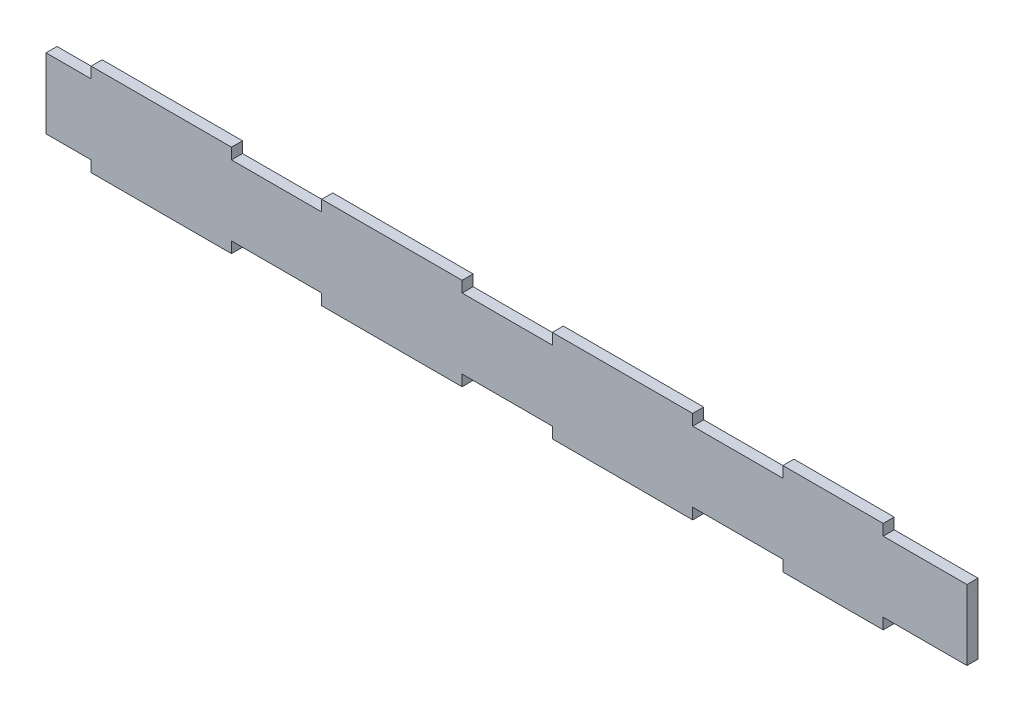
from build123d import *

# Parameters (mm, degrees)
BOSS_EXTRUDE1_DEPTH = 5.5


with BuildPart() as part:
    # Sketch1 → Boss-Extrude1 (new body)
    with BuildSketch(Plane.XY):
        Polygon((136.66821054, 49.948394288), (186.66821054, 49.948394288), (186.66821054, 55.448394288), (206.66821054, 55.448394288), (228.449972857, 55.448394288), (228.449972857, 90.448394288), (206.66821054, 90.448394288), (186.66821054, 90.448394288), (186.66821054, 95.948394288), (136.66821054, 95.948394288), (136.66821054, 90.448394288), (91.66821054, 90.448394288), (91.66821054, 95.948394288), (21.66821054, 95.948394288), (21.66821054, 90.448394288), (-23.33178946, 90.448394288), (-23.33178946, 95.948394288), (-93.33178946, 95.948394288), (-93.33178946, 90.448394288), (-138.33178946, 90.448394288), (-138.33178946, 95.948394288), (-208.33178946, 95.948394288), (-208.33178946, 90.448394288), (-230.83178946, 90.448394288), (-230.83178946, 55.448394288), (-208.33178946, 55.448394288), (-208.33178946, 49.948394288), (-138.33178946, 49.948394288), (-138.33178946, 55.448394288), (-93.33178946, 55.448394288), (-93.33178946, 49.948394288), (-23.33178946, 49.948394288), (-23.33178946, 55.448394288), (21.66821054, 55.448394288), (21.66821054, 49.948394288), (91.66821054, 49.948394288), (91.66821054, 55.448394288), (136.66821054, 55.448394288), align=None)
    extrude(amount=BOSS_EXTRUDE1_DEPTH)


solid = part.part
